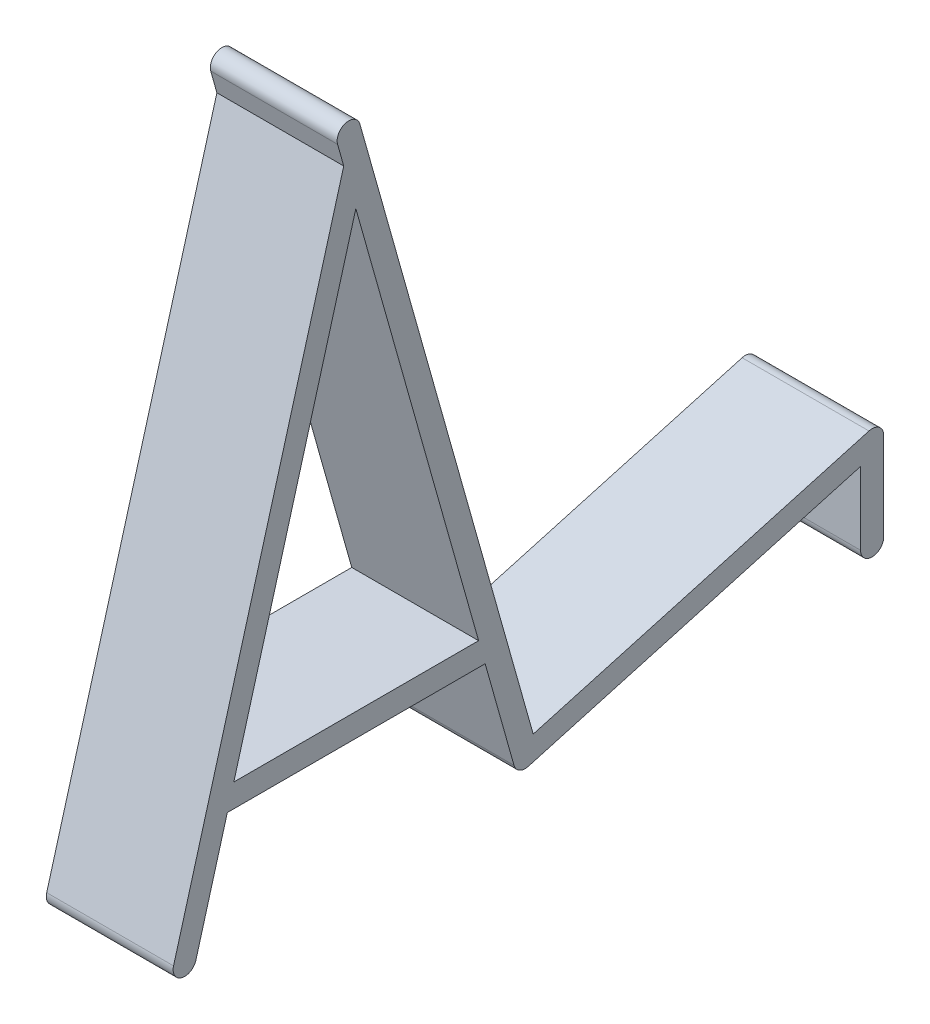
from build123d import *

# Parameters (mm, degrees)
BOSS_EXTRUDE1_DEPTH = 25.4
BOSS_EXTRUDE2_DEPTH = 25.4


with BuildPart() as part:
    # Sketch1 → Boss-Extrude1 (new body)
    with BuildSketch(Plane(origin=(0, 0, 0), x_dir=(0, 0, -1), z_dir=(1, 0, 0))):
        with BuildLine():
            Line((-78.919582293, 129.495291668), (-43.588960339, 4.135557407))
            ThreePointArc((-43.588960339, 4.135557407), (-45.195536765, 1.268025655), (-48.063068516, 2.874602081))
            Line((-48.063068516, 2.874602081), (-83.393690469, 128.234336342))
            ThreePointArc((-83.393690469, 128.234336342), (-81.787114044, 131.101868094), (-78.919582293, 129.495291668))
        make_face()
        with BuildLine():
            Line((-116.23882088, 2.189719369), (-81.982935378, 124.482541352))
            ThreePointArc((-81.982935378, 124.482541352), (-79.117968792, 126.093687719), (-77.506822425, 123.228721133))
            Line((-77.506822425, 123.228721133), (-111.762707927, 0.935899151))
            ThreePointArc((-111.762707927, 0.935899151), (-114.627674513, -0.675247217), (-116.23882088, 2.189719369))
        make_face()
        with BuildLine():
            Line((-52.085027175, 23.389040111), (-107.235899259, 23.389040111))
            ThreePointArc((-107.235899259, 23.389040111), (-109.560100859, 25.713241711), (-107.235899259, 28.037443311))
            Line((-107.235899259, 28.037443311), (-52.085027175, 28.037443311))
            ThreePointArc((-52.085027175, 28.037443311), (-49.760825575, 25.713241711), (-52.085027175, 23.389040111))
        make_face()
        with BuildLine():
            Line((-46.45649209, 5.742133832), (23.011488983, 25.320565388))
            ThreePointArc((23.011488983, 25.320565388), (25.879020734, 23.713988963), (24.272444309, 20.846457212))
            Line((24.272444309, 20.846457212), (-45.195536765, 1.268025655))
            ThreePointArc((-45.195536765, 1.268025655), (-48.063068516, 2.874602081), (-46.45649209, 5.742133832))
        make_face()
    extrude(amount=BOSS_EXTRUDE1_DEPTH)

    # Sketch3 → Boss-Extrude2 (add)
    with BuildSketch(Plane.ZY):
        with BuildLine():
            Line((-21.317866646, 23.0835113), (-21.317866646, 5.484092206))
            ThreePointArc((-21.317866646, 5.484092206), (-23.641966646, 3.159992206), (-25.966066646, 5.484092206))
            Line((-25.966066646, 5.484092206), (-25.966066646, 23.0835113))
            ThreePointArc((-25.966066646, 23.0835113), (-23.641966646, 25.4076113), (-21.317866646, 23.0835113))
        make_face()
    extrude(amount=-BOSS_EXTRUDE2_DEPTH)


solid = part.part
